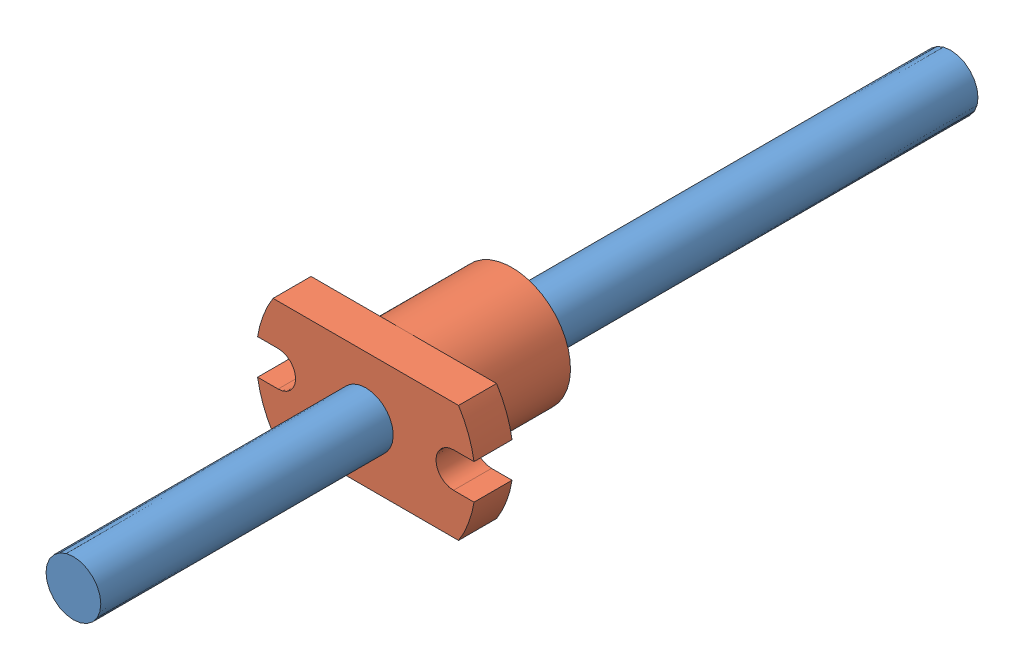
SolidWorks assembly Ametek-NTGFSR-018-0020-03.SLDASM, configuration Default (file format 6000). Lengths in mm.
Overall size (18.8 10.16 76.2).
2 component instances, 2 part files, 0 mates.
Components (placement in the parent):
- Ametek-NTGFSR-018-0020-03_screw(Default)-1: Ametek-NTGFSR-018-0020-03_screw(Default).sldprt [Default] at origin size (4.76 4.76 76.2)
- Ametek-NTGFSR-018-0020-03_NTGF3000(Default)-1: Ametek-NTGFSR-018-0020-03_NTGF3000(Default).sldprt [Default] x (0 -1 0) z (0 0 1) size (10.16 18.8 12.7)
